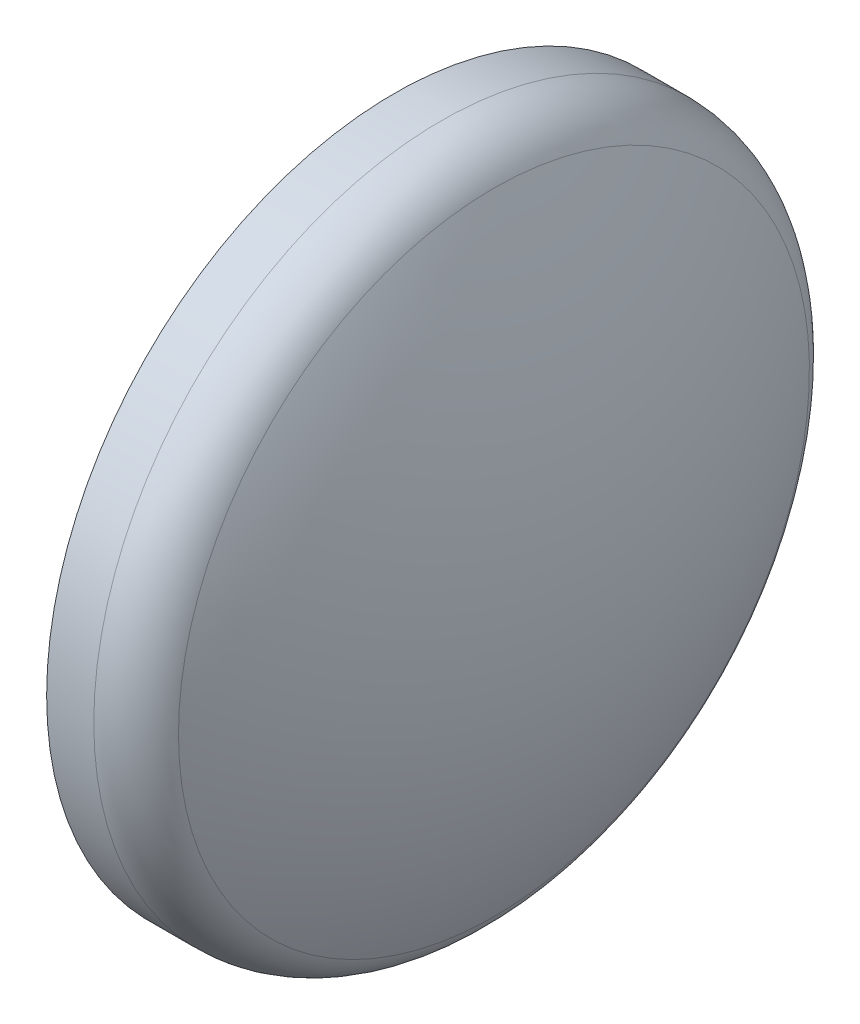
from build123d import *


with BuildPart() as part:
    # Esquisse1 → R_volution3 (revolve)
    with BuildSketch(Plane.XY, mode=Mode.PRIVATE) as r_volution3_sk:
        with BuildLine():
            Line((698.777598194, 0), (550, 0))
            Line((550, 0), (550, 295))
            Line((550, 295), (590, 295))
            ThreePointArc((590, 295), (616.131788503, 287.627803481), (634.557629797, 267.685185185))
            ThreePointArc((634.557629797, 267.685185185), (682.498008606, 137.640439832), (698.777598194, 0))
        make_face()
    revolve(r_volution3_sk.sketch.rotate(Axis((57.19013108, 0, 0), (1, 0, 0)), 90), axis=Axis((57.19013108, 0, 0), (1, 0, 0)))


solid = part.part
